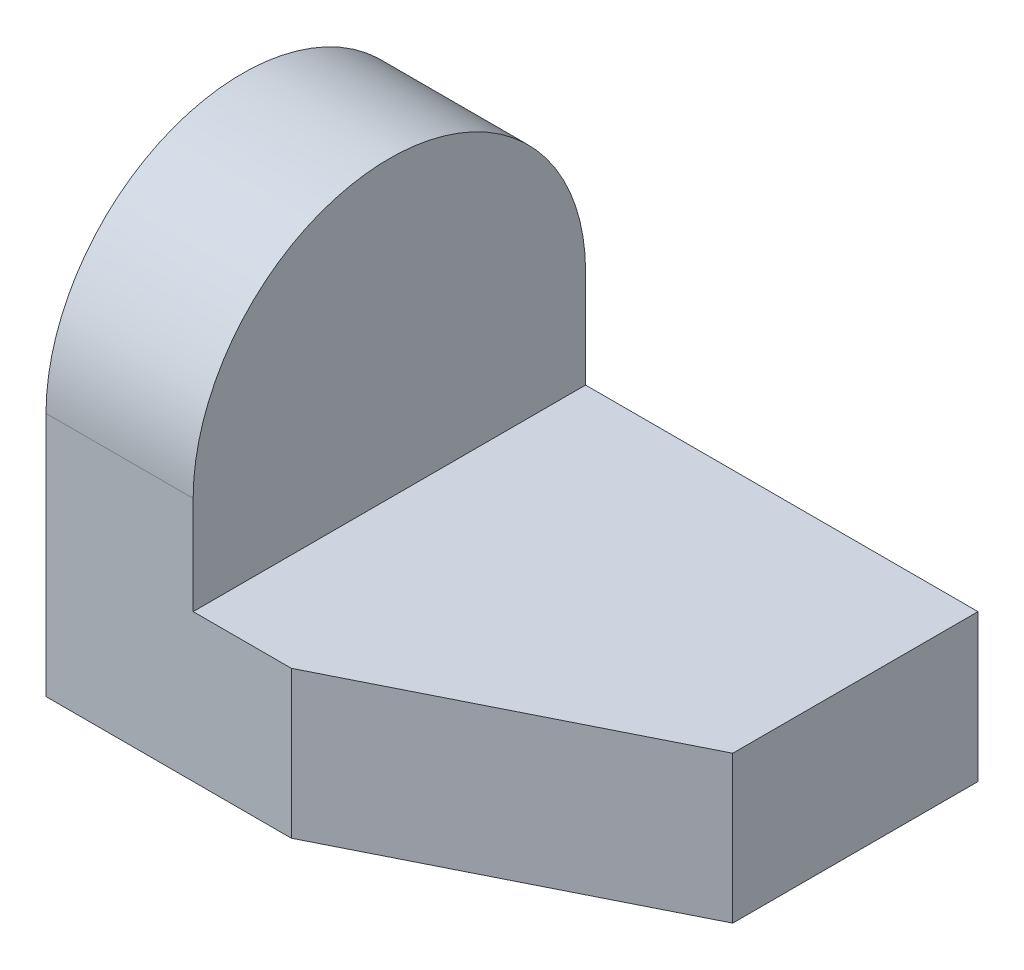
ISO-10303-21;
HEADER;
FILE_DESCRIPTION(('STEP AP214'),'2;1');
FILE_NAME('part.step','',(''),(''),'','','');
FILE_SCHEMA(('AUTOMOTIVE_DESIGN { 1 0 10303 214 1 1 1 1 }'));
ENDSEC;
DATA;
#1=APPLICATION_CONTEXT('core data for automotive mechanical design processes');
#2=APPLICATION_PROTOCOL_DEFINITION('international standard','automotive_design',2000,#1);
#3=PRODUCT_CONTEXT('',#1,'mechanical');
#4=PRODUCT('Part','Part','',(#3));
#5=PRODUCT_RELATED_PRODUCT_CATEGORY('part','',(#4));
#6=PRODUCT_DEFINITION_FORMATION('','',#4);
#7=PRODUCT_DEFINITION_CONTEXT('part definition',#1,'design');
#8=PRODUCT_DEFINITION('design','',#6,#7);
#9=PRODUCT_DEFINITION_SHAPE('','',#8);
#10=(LENGTH_UNIT() NAMED_UNIT(*) SI_UNIT(.MILLI.,.METRE.));
#11=(NAMED_UNIT(*) PLANE_ANGLE_UNIT() SI_UNIT($,.RADIAN.));
#12=(NAMED_UNIT(*) SI_UNIT($,.STERADIAN.) SOLID_ANGLE_UNIT());
#13=UNCERTAINTY_MEASURE_WITH_UNIT(LENGTH_MEASURE(1.E-05),#10,'distance_accuracy_value','');
#14=(GEOMETRIC_REPRESENTATION_CONTEXT(3) GLOBAL_UNCERTAINTY_ASSIGNED_CONTEXT((#13)) GLOBAL_UNIT_ASSIGNED_CONTEXT((#10,
#11,#12)) REPRESENTATION_CONTEXT('',''));
#15=CARTESIAN_POINT('',(0.,0.,0.));
#16=DIRECTION('',(0.,0.,1.));
#17=DIRECTION('',(1.,0.,0.));
#18=AXIS2_PLACEMENT_3D('',#15,#16,#17);
#19=CARTESIAN_POINT('',(333.868830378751,50.,40.));
#20=DIRECTION('',(-1.,0.,0.));
#21=DIRECTION('',(0.,-1.,0.));
#22=AXIS2_PLACEMENT_3D('',#19,#20,#21);
#23=CYLINDRICAL_SURFACE('',#22,40.);
#24=DIRECTION('',(-1.,0.,0.));
#25=VECTOR('',#24,1.);
#26=CARTESIAN_POINT('',(333.868830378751,50.,80.));
#27=LINE('',#26,#25);
#28=CARTESIAN_POINT('',(30.,50.,80.));
#29=VERTEX_POINT('',#28);
#30=CARTESIAN_POINT('',(0.,50.,80.));
#31=VERTEX_POINT('',#30);
#32=EDGE_CURVE('E47',#29,#31,#27,.T.);
#33=ORIENTED_EDGE('',*,*,#32,.F.);
#34=CARTESIAN_POINT('',(30.,50.,40.));
#35=DIRECTION('',(1.,0.,0.));
#36=DIRECTION('',(0.,1.,0.));
#37=AXIS2_PLACEMENT_3D('',#34,#35,#36);
#38=CIRCLE('',#37,40.);
#39=CARTESIAN_POINT('',(30.,50.,0.));
#40=VERTEX_POINT('',#39);
#41=EDGE_CURVE('E55',#40,#29,#38,.T.);
#42=ORIENTED_EDGE('',*,*,#41,.F.);
#43=DIRECTION('',(-1.,0.,0.));
#44=VECTOR('',#43,1.);
#45=CARTESIAN_POINT('',(333.868830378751,50.,0.));
#46=LINE('',#45,#44);
#47=CARTESIAN_POINT('',(0.,50.,0.));
#48=VERTEX_POINT('',#47);
#49=EDGE_CURVE('E11',#40,#48,#46,.T.);
#50=ORIENTED_EDGE('',*,*,#49,.T.);
#51=CARTESIAN_POINT('',(0.,50.,40.));
#52=DIRECTION('',(1.,0.,0.));
#53=DIRECTION('',(0.,1.,0.));
#54=AXIS2_PLACEMENT_3D('',#51,#52,#53);
#55=CIRCLE('',#54,40.);
#56=EDGE_CURVE('E91',#48,#31,#55,.T.);
#57=ORIENTED_EDGE('',*,*,#56,.T.);
#58=EDGE_LOOP('',(#33,#42,#50,#57));
#59=FACE_BOUND('',#58,.T.);
#60=ADVANCED_FACE('F32',(#59),#23,.T.);
#61=CARTESIAN_POINT('',(30.,90.,80.));
#62=DIRECTION('',(1.,0.,0.));
#63=DIRECTION('',(0.,1.,0.));
#64=AXIS2_PLACEMENT_3D('',#61,#62,#63);
#65=PLANE('',#64);
#66=ORIENTED_EDGE('',*,*,#41,.T.);
#67=DIRECTION('',(0.,-1.,0.));
#68=VECTOR('',#67,1.);
#69=CARTESIAN_POINT('',(30.,90.,80.));
#70=LINE('',#69,#68);
#71=CARTESIAN_POINT('',(30.,30.,80.));
#72=VERTEX_POINT('',#71);
#73=EDGE_CURVE('E119',#29,#72,#70,.T.);
#74=ORIENTED_EDGE('',*,*,#73,.T.);
#75=DIRECTION('',(0.,0.,-1.));
#76=VECTOR('',#75,1.);
#77=CARTESIAN_POINT('',(30.,30.,80.));
#78=LINE('',#77,#76);
#79=CARTESIAN_POINT('',(30.,30.,0.));
#80=VERTEX_POINT('',#79);
#81=EDGE_CURVE('E129',#72,#80,#78,.T.);
#82=ORIENTED_EDGE('',*,*,#81,.T.);
#83=DIRECTION('',(0.,-1.,0.));
#84=VECTOR('',#83,1.);
#85=CARTESIAN_POINT('',(30.,90.,0.));
#86=LINE('',#85,#84);
#87=EDGE_CURVE('E107',#40,#80,#86,.T.);
#88=ORIENTED_EDGE('',*,*,#87,.F.);
#89=EDGE_LOOP('',(#66,#74,#82,#88));
#90=FACE_BOUND('',#89,.T.);
#91=ADVANCED_FACE('F160',(#90),#65,.T.);
#92=CARTESIAN_POINT('',(0.,90.,80.));
#93=DIRECTION('',(1.,0.,0.));
#94=DIRECTION('',(0.,1.,0.));
#95=AXIS2_PLACEMENT_3D('',#92,#93,#94);
#96=PLANE('',#95);
#97=ORIENTED_EDGE('',*,*,#56,.F.);
#98=DIRECTION('',(0.,-1.,0.));
#99=VECTOR('',#98,1.);
#100=CARTESIAN_POINT('',(0.,90.,0.));
#101=LINE('',#100,#99);
#102=CARTESIAN_POINT('',(0.,0.,0.));
#103=VERTEX_POINT('',#102);
#104=EDGE_CURVE('E95',#48,#103,#101,.T.);
#105=ORIENTED_EDGE('',*,*,#104,.T.);
#106=DIRECTION('',(0.,0.,-1.));
#107=VECTOR('',#106,1.);
#108=CARTESIAN_POINT('',(0.,0.,80.));
#109=LINE('',#108,#107);
#110=CARTESIAN_POINT('',(0.,0.,80.));
#111=VERTEX_POINT('',#110);
#112=EDGE_CURVE('E121',#111,#103,#109,.T.);
#113=ORIENTED_EDGE('',*,*,#112,.F.);
#114=DIRECTION('',(0.,-1.,0.));
#115=VECTOR('',#114,1.);
#116=CARTESIAN_POINT('',(0.,90.,80.));
#117=LINE('',#116,#115);
#118=EDGE_CURVE('E97',#31,#111,#117,.T.);
#119=ORIENTED_EDGE('',*,*,#118,.F.);
#120=EDGE_LOOP('',(#97,#105,#113,#119));
#121=FACE_BOUND('',#120,.T.);
#122=ADVANCED_FACE('F93',(#121),#96,.F.);
#123=CARTESIAN_POINT('',(0.,0.,80.));
#124=DIRECTION('',(0.,1.,0.));
#125=DIRECTION('',(0.,0.,1.));
#126=AXIS2_PLACEMENT_3D('',#123,#124,#125);
#127=PLANE('',#126);
#128=DIRECTION('',(0.,0.,-1.));
#129=VECTOR('',#128,1.);
#130=CARTESIAN_POINT('',(110.,0.,80.));
#131=LINE('',#130,#129);
#132=CARTESIAN_POINT('',(110.,0.,50.));
#133=VERTEX_POINT('',#132);
#134=CARTESIAN_POINT('',(110.,0.,0.));
#135=VERTEX_POINT('',#134);
#136=EDGE_CURVE('E134',#133,#135,#131,.T.);
#137=ORIENTED_EDGE('',*,*,#136,.F.);
#138=DIRECTION('',(-0.894427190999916,0.,0.447213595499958));
#139=VECTOR('',#138,1.);
#140=CARTESIAN_POINT('',(110.,0.,50.));
#141=LINE('',#140,#139);
#142=CARTESIAN_POINT('',(50.,0.,80.));
#143=VERTEX_POINT('',#142);
#144=EDGE_CURVE('E139',#133,#143,#141,.T.);
#145=ORIENTED_EDGE('',*,*,#144,.T.);
#146=DIRECTION('',(1.,0.,0.));
#147=VECTOR('',#146,1.);
#148=CARTESIAN_POINT('',(0.,0.,80.));
#149=LINE('',#148,#147);
#150=EDGE_CURVE('E106',#111,#143,#149,.T.);
#151=ORIENTED_EDGE('',*,*,#150,.F.);
#152=ORIENTED_EDGE('',*,*,#112,.T.);
#153=DIRECTION('',(1.,0.,0.));
#154=VECTOR('',#153,1.);
#155=CARTESIAN_POINT('',(0.,0.,0.));
#156=LINE('',#155,#154);
#157=EDGE_CURVE('E105',#103,#135,#156,.T.);
#158=ORIENTED_EDGE('',*,*,#157,.T.);
#159=EDGE_LOOP('',(#137,#145,#151,#152,#158));
#160=FACE_BOUND('',#159,.T.);
#161=ADVANCED_FACE('F158',(#160),#127,.F.);
#162=CARTESIAN_POINT('',(110.,30.,80.));
#163=DIRECTION('',(1.,0.,0.));
#164=DIRECTION('',(0.,0.,-1.));
#165=AXIS2_PLACEMENT_3D('',#162,#163,#164);
#166=PLANE('',#165);
#167=DIRECTION('',(0.,0.,-1.));
#168=VECTOR('',#167,1.);
#169=CARTESIAN_POINT('',(110.,30.,80.));
#170=LINE('',#169,#168);
#171=CARTESIAN_POINT('',(110.,30.,50.));
#172=VERTEX_POINT('',#171);
#173=CARTESIAN_POINT('',(110.,30.,0.));
#174=VERTEX_POINT('',#173);
#175=EDGE_CURVE('E132',#172,#174,#170,.T.);
#176=ORIENTED_EDGE('',*,*,#175,.F.);
#177=DIRECTION('',(0.,-1.,0.));
#178=VECTOR('',#177,1.);
#179=CARTESIAN_POINT('',(110.,0.,50.));
#180=LINE('',#179,#178);
#181=EDGE_CURVE('E136',#172,#133,#180,.T.);
#182=ORIENTED_EDGE('',*,*,#181,.T.);
#183=ORIENTED_EDGE('',*,*,#136,.T.);
#184=DIRECTION('',(0.,-1.,0.));
#185=VECTOR('',#184,1.);
#186=CARTESIAN_POINT('',(110.,30.,0.));
#187=LINE('',#186,#185);
#188=EDGE_CURVE('E110',#174,#135,#187,.T.);
#189=ORIENTED_EDGE('',*,*,#188,.F.);
#190=EDGE_LOOP('',(#176,#182,#183,#189));
#191=FACE_BOUND('',#190,.T.);
#192=ADVANCED_FACE('F154',(#191),#166,.T.);
#193=CARTESIAN_POINT('',(0.,30.,80.));
#194=DIRECTION('',(0.,1.,0.));
#195=DIRECTION('',(0.,0.,1.));
#196=AXIS2_PLACEMENT_3D('',#193,#194,#195);
#197=PLANE('',#196);
#198=DIRECTION('',(1.,0.,0.));
#199=VECTOR('',#198,1.);
#200=CARTESIAN_POINT('',(0.,30.,80.));
#201=LINE('',#200,#199);
#202=CARTESIAN_POINT('',(50.,30.,80.));
#203=VERTEX_POINT('',#202);
#204=EDGE_CURVE('E116',#72,#203,#201,.T.);
#205=ORIENTED_EDGE('',*,*,#204,.T.);
#206=DIRECTION('',(0.894427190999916,0.,-0.447213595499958));
#207=VECTOR('',#206,1.);
#208=CARTESIAN_POINT('',(10.,30.,100.));
#209=LINE('',#208,#207);
#210=EDGE_CURVE('E40',#203,#172,#209,.T.);
#211=ORIENTED_EDGE('',*,*,#210,.T.);
#212=ORIENTED_EDGE('',*,*,#175,.T.);
#213=DIRECTION('',(1.,0.,0.));
#214=VECTOR('',#213,1.);
#215=CARTESIAN_POINT('',(0.,30.,0.));
#216=LINE('',#215,#214);
#217=EDGE_CURVE('E124',#80,#174,#216,.T.);
#218=ORIENTED_EDGE('',*,*,#217,.F.);
#219=ORIENTED_EDGE('',*,*,#81,.F.);
#220=EDGE_LOOP('',(#205,#211,#212,#218,#219));
#221=FACE_BOUND('',#220,.T.);
#222=ADVANCED_FACE('F145',(#221),#197,.T.);
#223=CARTESIAN_POINT('',(110.,0.,80.));
#224=DIRECTION('',(0.,0.,-1.));
#225=DIRECTION('',(-1.,0.,0.));
#226=AXIS2_PLACEMENT_3D('',#223,#224,#225);
#227=PLANE('',#226);
#228=ORIENTED_EDGE('',*,*,#73,.F.);
#229=ORIENTED_EDGE('',*,*,#32,.T.);
#230=ORIENTED_EDGE('',*,*,#118,.T.);
#231=ORIENTED_EDGE('',*,*,#150,.T.);
#232=DIRECTION('',(0.,1.,0.));
#233=VECTOR('',#232,1.);
#234=CARTESIAN_POINT('',(50.,30.,80.));
#235=LINE('',#234,#233);
#236=EDGE_CURVE('E141',#143,#203,#235,.T.);
#237=ORIENTED_EDGE('',*,*,#236,.T.);
#238=ORIENTED_EDGE('',*,*,#204,.F.);
#239=EDGE_LOOP('',(#228,#229,#230,#231,#237,#238));
#240=FACE_BOUND('',#239,.T.);
#241=ADVANCED_FACE('F159',(#240),#227,.F.);
#242=CARTESIAN_POINT('',(110.,0.,0.));
#243=DIRECTION('',(0.,0.,-1.));
#244=DIRECTION('',(-1.,0.,0.));
#245=AXIS2_PLACEMENT_3D('',#242,#243,#244);
#246=PLANE('',#245);
#247=ORIENTED_EDGE('',*,*,#49,.F.);
#248=ORIENTED_EDGE('',*,*,#87,.T.);
#249=ORIENTED_EDGE('',*,*,#217,.T.);
#250=ORIENTED_EDGE('',*,*,#188,.T.);
#251=ORIENTED_EDGE('',*,*,#157,.F.);
#252=ORIENTED_EDGE('',*,*,#104,.F.);
#253=EDGE_LOOP('',(#247,#248,#249,#250,#251,#252));
#254=FACE_BOUND('',#253,.T.);
#255=ADVANCED_FACE('F102',(#254),#246,.T.);
#256=CARTESIAN_POINT('',(110.,30.,50.));
#257=DIRECTION('',(0.447213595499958,0.,0.894427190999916));
#258=DIRECTION('',(0.894427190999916,0.,-0.447213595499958));
#259=AXIS2_PLACEMENT_3D('',#256,#257,#258);
#260=PLANE('',#259);
#261=ORIENTED_EDGE('',*,*,#210,.F.);
#262=ORIENTED_EDGE('',*,*,#236,.F.);
#263=ORIENTED_EDGE('',*,*,#144,.F.);
#264=ORIENTED_EDGE('',*,*,#181,.F.);
#265=EDGE_LOOP('',(#261,#262,#263,#264));
#266=FACE_BOUND('',#265,.T.);
#267=ADVANCED_FACE('F34',(#266),#260,.T.);
#268=CLOSED_SHELL('',(#60,#91,#122,#161,#192,#222,#241,#255,#267));
#269=MANIFOLD_SOLID_BREP('B2',#268);
#270=ADVANCED_BREP_SHAPE_REPRESENTATION('',(#18,#269),#14);
#271=SHAPE_DEFINITION_REPRESENTATION(#9,#270);
ENDSEC;
END-ISO-10303-21;
